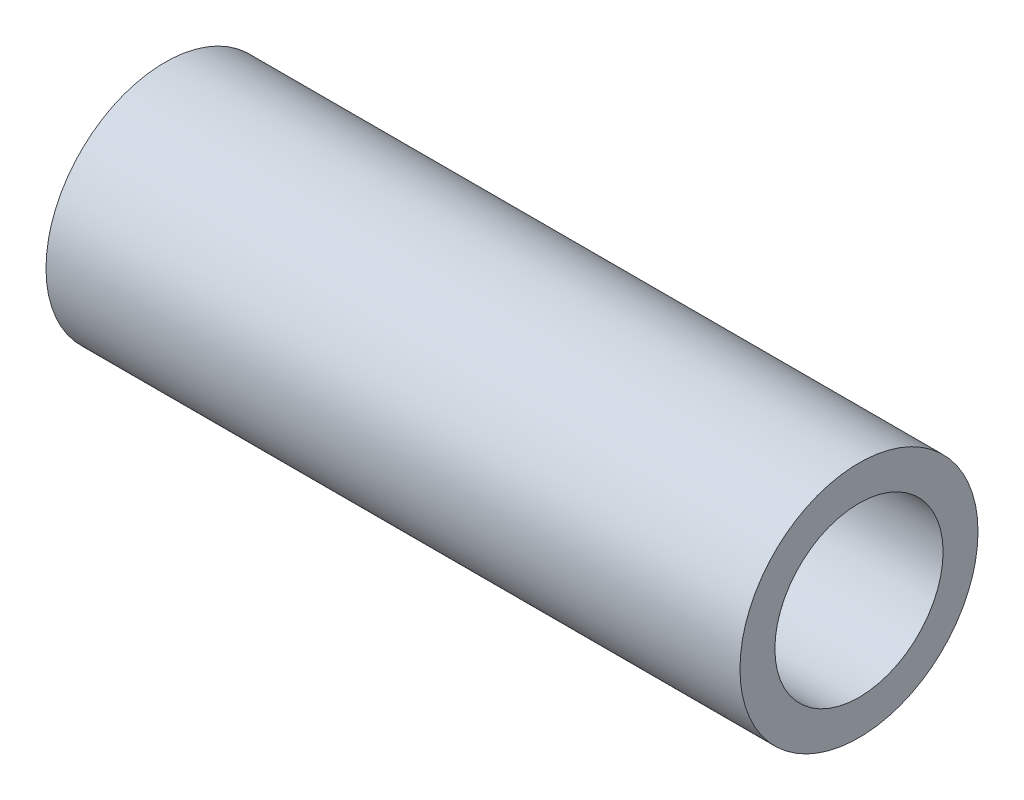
from build123d import *

# Parameters (mm, degrees)
SKETCH1_R    = 4.953
SKETCH1_R_2  = 3.5
SPACER_DEPTH = 28.8798


with BuildPart() as part:
    # Sketch1 → Spacer (new body)
    with BuildSketch(Plane(origin=(0, 0, 0), x_dir=(0, 0, -1), z_dir=(1, 0, 0))):
        Circle(SKETCH1_R)
        Circle(SKETCH1_R_2, mode=Mode.SUBTRACT)
    extrude(amount=SPACER_DEPTH)


solid = part.part
